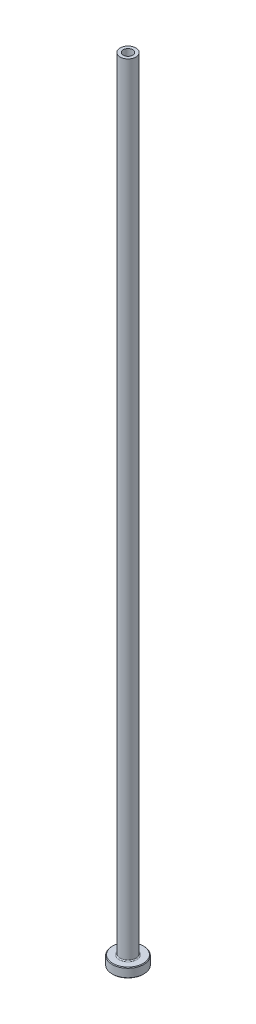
ISO-10303-21;
HEADER;
FILE_DESCRIPTION(('STEP AP214'),'2;1');
FILE_NAME('part.step','',(''),(''),'','','');
FILE_SCHEMA(('AUTOMOTIVE_DESIGN { 1 0 10303 214 1 1 1 1 }'));
ENDSEC;
DATA;
#1=APPLICATION_CONTEXT('core data for automotive mechanical design processes');
#2=APPLICATION_PROTOCOL_DEFINITION('international standard','automotive_design',2000,#1);
#3=PRODUCT_CONTEXT('',#1,'mechanical');
#4=PRODUCT('Part','Part','',(#3));
#5=PRODUCT_RELATED_PRODUCT_CATEGORY('part','',(#4));
#6=PRODUCT_DEFINITION_FORMATION('','',#4);
#7=PRODUCT_DEFINITION_CONTEXT('part definition',#1,'design');
#8=PRODUCT_DEFINITION('design','',#6,#7);
#9=PRODUCT_DEFINITION_SHAPE('','',#8);
#10=(LENGTH_UNIT() NAMED_UNIT(*) SI_UNIT(.MILLI.,.METRE.));
#11=(NAMED_UNIT(*) PLANE_ANGLE_UNIT() SI_UNIT($,.RADIAN.));
#12=(NAMED_UNIT(*) SI_UNIT($,.STERADIAN.) SOLID_ANGLE_UNIT());
#13=UNCERTAINTY_MEASURE_WITH_UNIT(LENGTH_MEASURE(1.E-05),#10,'distance_accuracy_value','');
#14=(GEOMETRIC_REPRESENTATION_CONTEXT(3) GLOBAL_UNCERTAINTY_ASSIGNED_CONTEXT((#13)) GLOBAL_UNIT_ASSIGNED_CONTEXT((#10,
#11,#12)) REPRESENTATION_CONTEXT('',''));
#15=CARTESIAN_POINT('',(0.,0.,0.));
#16=DIRECTION('',(0.,0.,1.));
#17=DIRECTION('',(1.,0.,0.));
#18=AXIS2_PLACEMENT_3D('',#15,#16,#17);
#19=CARTESIAN_POINT('',(0.,92.1876809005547,0.));
#20=DIRECTION('',(0.,1.,0.));
#21=DIRECTION('',(0.,0.,1.));
#22=AXIS2_PLACEMENT_3D('',#19,#20,#21);
#23=CYLINDRICAL_SURFACE('',#22,1.50000000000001);
#24=CARTESIAN_POINT('',(0.,250.,0.));
#25=DIRECTION('',(0.,1.,0.));
#26=DIRECTION('',(0.,0.,1.));
#27=AXIS2_PLACEMENT_3D('',#24,#25,#26);
#28=CIRCLE('',#27,1.50000000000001);
#29=CARTESIAN_POINT('',(0.,250.,1.50000000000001));
#30=VERTEX_POINT('',#29);
#31=EDGE_CURVE('E62',#30,#30,#28,.T.);
#32=ORIENTED_EDGE('',*,*,#31,.T.);
#33=EDGE_LOOP('',(#32));
#34=FACE_BOUND('',#33,.T.);
#35=CARTESIAN_POINT('',(0.,205.,0.));
#36=DIRECTION('',(0.,1.,0.));
#37=DIRECTION('',(0.,0.,1.));
#38=AXIS2_PLACEMENT_3D('',#35,#36,#37);
#39=CIRCLE('',#38,1.50000000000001);
#40=CARTESIAN_POINT('',(0.,205.,1.50000000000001));
#41=VERTEX_POINT('',#40);
#42=EDGE_CURVE('E71',#41,#41,#39,.T.);
#43=ORIENTED_EDGE('',*,*,#42,.F.);
#44=EDGE_LOOP('',(#43));
#45=FACE_BOUND('',#44,.T.);
#46=ADVANCED_FACE('F30',(#34,#45),#23,.F.);
#47=CARTESIAN_POINT('',(-1.50000000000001,250.,0.));
#48=DIRECTION('',(0.,1.,0.));
#49=DIRECTION('',(0.,0.,1.));
#50=AXIS2_PLACEMENT_3D('',#47,#48,#49);
#51=PLANE('',#50);
#52=CARTESIAN_POINT('',(0.,250.,0.));
#53=DIRECTION('',(0.,1.,0.));
#54=DIRECTION('',(0.,0.,1.));
#55=AXIS2_PLACEMENT_3D('',#52,#53,#54);
#56=CIRCLE('',#55,2.50000000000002);
#57=CARTESIAN_POINT('',(0.,250.,2.50000000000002));
#58=VERTEX_POINT('',#57);
#59=EDGE_CURVE('E65',#58,#58,#56,.T.);
#60=ORIENTED_EDGE('',*,*,#59,.T.);
#61=EDGE_LOOP('',(#60));
#62=FACE_BOUND('',#61,.T.);
#63=ORIENTED_EDGE('',*,*,#31,.F.);
#64=EDGE_LOOP('',(#63));
#65=FACE_BOUND('',#64,.T.);
#66=ADVANCED_FACE('F79',(#62,#65),#51,.T.);
#67=CARTESIAN_POINT('',(0.,92.1876809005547,0.));
#68=DIRECTION('',(0.,1.,0.));
#69=DIRECTION('',(0.,0.,1.));
#70=AXIS2_PLACEMENT_3D('',#67,#68,#69);
#71=CYLINDRICAL_SURFACE('',#70,2.5);
#72=CARTESIAN_POINT('',(0.,3.3,0.));
#73=DIRECTION('',(0.,1.,0.));
#74=DIRECTION('',(0.,0.,1.));
#75=AXIS2_PLACEMENT_3D('',#72,#73,#74);
#76=CIRCLE('',#75,2.5);
#77=CARTESIAN_POINT('',(0.,3.3,2.5));
#78=VERTEX_POINT('',#77);
#79=EDGE_CURVE('E59',#78,#78,#76,.T.);
#80=ORIENTED_EDGE('',*,*,#79,.T.);
#81=EDGE_LOOP('',(#80));
#82=FACE_BOUND('',#81,.T.);
#83=ORIENTED_EDGE('',*,*,#59,.F.);
#84=EDGE_LOOP('',(#83));
#85=FACE_BOUND('',#84,.T.);
#86=ADVANCED_FACE('F85',(#82,#85),#71,.T.);
#87=CARTESIAN_POINT('',(-2.49999999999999,3.,0.));
#88=DIRECTION('',(0.,1.,0.));
#89=DIRECTION('',(0.,0.,1.));
#90=AXIS2_PLACEMENT_3D('',#87,#88,#89);
#91=PLANE('',#90);
#92=CARTESIAN_POINT('',(0.,3.,0.));
#93=DIRECTION('',(0.,1.,0.));
#94=DIRECTION('',(0.,0.,1.));
#95=AXIS2_PLACEMENT_3D('',#92,#93,#94);
#96=CIRCLE('',#95,4.8);
#97=CARTESIAN_POINT('',(0.,3.,4.8));
#98=VERTEX_POINT('',#97);
#99=EDGE_CURVE('E53',#98,#98,#96,.T.);
#100=ORIENTED_EDGE('',*,*,#99,.T.);
#101=EDGE_LOOP('',(#100));
#102=FACE_BOUND('',#101,.T.);
#103=CARTESIAN_POINT('',(0.,3.,0.));
#104=DIRECTION('',(0.,1.,0.));
#105=DIRECTION('',(0.,0.,1.));
#106=AXIS2_PLACEMENT_3D('',#103,#104,#105);
#107=CIRCLE('',#106,2.8);
#108=CARTESIAN_POINT('',(0.,3.,2.8));
#109=VERTEX_POINT('',#108);
#110=EDGE_CURVE('E56',#109,#109,#107,.F.);
#111=ORIENTED_EDGE('',*,*,#110,.T.);
#112=EDGE_LOOP('',(#111));
#113=FACE_BOUND('',#112,.T.);
#114=ADVANCED_FACE('F111',(#102,#113),#91,.T.);
#115=CARTESIAN_POINT('',(0.,92.1876809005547,0.));
#116=DIRECTION('',(0.,1.,0.));
#117=DIRECTION('',(0.,0.,1.));
#118=AXIS2_PLACEMENT_3D('',#115,#116,#117);
#119=CYLINDRICAL_SURFACE('',#118,4.99999999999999);
#120=CARTESIAN_POINT('',(0.,2.80000000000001,0.));
#121=DIRECTION('',(0.,1.,0.));
#122=DIRECTION('',(0.,0.,1.));
#123=AXIS2_PLACEMENT_3D('',#120,#121,#122);
#124=CIRCLE('',#123,4.99999999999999);
#125=CARTESIAN_POINT('',(0.,2.80000000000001,4.99999999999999));
#126=VERTEX_POINT('',#125);
#127=EDGE_CURVE('E45',#126,#126,#124,.F.);
#128=ORIENTED_EDGE('',*,*,#127,.T.);
#129=EDGE_LOOP('',(#128));
#130=FACE_BOUND('',#129,.T.);
#131=CARTESIAN_POINT('',(0.,0.200000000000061,0.));
#132=DIRECTION('',(0.,-1.,0.));
#133=DIRECTION('',(0.,0.,-1.));
#134=AXIS2_PLACEMENT_3D('',#131,#132,#133);
#135=CIRCLE('',#134,4.99999999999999);
#136=CARTESIAN_POINT('',(0.,0.200000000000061,-4.99999999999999));
#137=VERTEX_POINT('',#136);
#138=EDGE_CURVE('E50',#137,#137,#135,.F.);
#139=ORIENTED_EDGE('',*,*,#138,.T.);
#140=EDGE_LOOP('',(#139));
#141=FACE_BOUND('',#140,.T.);
#142=ADVANCED_FACE('F108',(#130,#141),#119,.T.);
#143=CARTESIAN_POINT('',(-4.99999999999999,0.,0.));
#144=DIRECTION('',(0.,-1.,0.));
#145=DIRECTION('',(0.,0.,-1.));
#146=AXIS2_PLACEMENT_3D('',#143,#144,#145);
#147=PLANE('',#146);
#148=CARTESIAN_POINT('',(0.,0.,0.));
#149=DIRECTION('',(0.,-1.,0.));
#150=DIRECTION('',(0.,0.,-1.));
#151=AXIS2_PLACEMENT_3D('',#148,#149,#150);
#152=CIRCLE('',#151,2.25);
#153=CARTESIAN_POINT('',(0.,0.,-2.25));
#154=VERTEX_POINT('',#153);
#155=EDGE_CURVE('E37',#154,#154,#152,.F.);
#156=ORIENTED_EDGE('',*,*,#155,.T.);
#157=EDGE_LOOP('',(#156));
#158=FACE_BOUND('',#157,.T.);
#159=CARTESIAN_POINT('',(0.,0.,0.));
#160=DIRECTION('',(0.,-1.,0.));
#161=DIRECTION('',(0.,0.,-1.));
#162=AXIS2_PLACEMENT_3D('',#159,#160,#161);
#163=CIRCLE('',#162,4.79999999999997);
#164=CARTESIAN_POINT('',(0.,0.,-4.79999999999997));
#165=VERTEX_POINT('',#164);
#166=EDGE_CURVE('E41',#165,#165,#163,.T.);
#167=ORIENTED_EDGE('',*,*,#166,.T.);
#168=EDGE_LOOP('',(#167));
#169=FACE_BOUND('',#168,.T.);
#170=ADVANCED_FACE('F110',(#158,#169),#147,.T.);
#171=CARTESIAN_POINT('',(0.,92.1876809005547,0.));
#172=DIRECTION('',(0.,1.,0.));
#173=DIRECTION('',(0.,0.,1.));
#174=AXIS2_PLACEMENT_3D('',#171,#172,#173);
#175=CYLINDRICAL_SURFACE('',#174,1.75);
#176=CARTESIAN_POINT('',(0.,0.500000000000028,0.));
#177=DIRECTION('',(0.,-1.,0.));
#178=DIRECTION('',(0.,0.,-1.));
#179=AXIS2_PLACEMENT_3D('',#176,#177,#178);
#180=CIRCLE('',#179,1.75);
#181=CARTESIAN_POINT('',(0.,0.500000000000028,-1.75));
#182=VERTEX_POINT('',#181);
#183=EDGE_CURVE('E10',#182,#182,#180,.T.);
#184=ORIENTED_EDGE('',*,*,#183,.T.);
#185=EDGE_LOOP('',(#184));
#186=FACE_BOUND('',#185,.T.);
#187=CARTESIAN_POINT('',(0.,193.,0.));
#188=DIRECTION('',(0.,1.,0.));
#189=DIRECTION('',(0.,0.,1.));
#190=AXIS2_PLACEMENT_3D('',#187,#188,#189);
#191=CIRCLE('',#190,1.75000000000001);
#192=CARTESIAN_POINT('',(0.,193.,1.75000000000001));
#193=VERTEX_POINT('',#192);
#194=EDGE_CURVE('E68',#193,#193,#191,.T.);
#195=ORIENTED_EDGE('',*,*,#194,.T.);
#196=EDGE_LOOP('',(#195));
#197=FACE_BOUND('',#196,.T.);
#198=ADVANCED_FACE('F118',(#186,#197),#175,.F.);
#199=CARTESIAN_POINT('',(0.,193.,0.));
#200=DIRECTION('',(0.,-1.,0.));
#201=DIRECTION('',(0.,0.,-1.));
#202=AXIS2_PLACEMENT_3D('',#199,#200,#201);
#203=CONICAL_SURFACE('',#202,1.75000000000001,0.0208303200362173);
#204=ORIENTED_EDGE('',*,*,#42,.T.);
#205=EDGE_LOOP('',(#204));
#206=FACE_BOUND('',#205,.T.);
#207=ORIENTED_EDGE('',*,*,#194,.F.);
#208=EDGE_LOOP('',(#207));
#209=FACE_BOUND('',#208,.T.);
#210=ADVANCED_FACE('F75',(#206,#209),#203,.F.);
#211=CARTESIAN_POINT('',(0.,3.3,0.));
#212=DIRECTION('',(0.,1.,0.));
#213=DIRECTION('',(0.,0.,1.));
#214=AXIS2_PLACEMENT_3D('',#211,#212,#213);
#215=TOROIDAL_SURFACE('',#214,2.8,0.3);
#216=ORIENTED_EDGE('',*,*,#110,.F.);
#217=EDGE_LOOP('',(#216));
#218=FACE_BOUND('',#217,.T.);
#219=ORIENTED_EDGE('',*,*,#79,.F.);
#220=EDGE_LOOP('',(#219));
#221=FACE_BOUND('',#220,.T.);
#222=ADVANCED_FACE('F90',(#218,#221),#215,.F.);
#223=CARTESIAN_POINT('',(0.,3.,0.));
#224=DIRECTION('',(0.,-1.,0.));
#225=DIRECTION('',(0.,0.,-1.));
#226=AXIS2_PLACEMENT_3D('',#223,#224,#225);
#227=CONICAL_SURFACE('',#226,4.8,0.785398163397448);
#228=ORIENTED_EDGE('',*,*,#127,.F.);
#229=EDGE_LOOP('',(#228));
#230=FACE_BOUND('',#229,.T.);
#231=ORIENTED_EDGE('',*,*,#99,.F.);
#232=EDGE_LOOP('',(#231));
#233=FACE_BOUND('',#232,.T.);
#234=ADVANCED_FACE('F93',(#230,#233),#227,.T.);
#235=CARTESIAN_POINT('',(0.,0.200000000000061,0.));
#236=DIRECTION('',(0.,1.,0.));
#237=DIRECTION('',(0.,0.,1.));
#238=AXIS2_PLACEMENT_3D('',#235,#236,#237);
#239=CONICAL_SURFACE('',#238,4.99999999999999,0.785398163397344);
#240=ORIENTED_EDGE('',*,*,#166,.F.);
#241=EDGE_LOOP('',(#240));
#242=FACE_BOUND('',#241,.T.);
#243=ORIENTED_EDGE('',*,*,#138,.F.);
#244=EDGE_LOOP('',(#243));
#245=FACE_BOUND('',#244,.T.);
#246=ADVANCED_FACE('F96',(#242,#245),#239,.T.);
#247=CARTESIAN_POINT('',(0.,0.,0.));
#248=DIRECTION('',(0.,-1.,0.));
#249=DIRECTION('',(0.,0.,-1.));
#250=AXIS2_PLACEMENT_3D('',#247,#248,#249);
#251=CONICAL_SURFACE('',#250,2.25,0.78539816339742);
#252=ORIENTED_EDGE('',*,*,#183,.F.);
#253=EDGE_LOOP('',(#252));
#254=FACE_BOUND('',#253,.T.);
#255=ORIENTED_EDGE('',*,*,#155,.F.);
#256=EDGE_LOOP('',(#255));
#257=FACE_BOUND('',#256,.T.);
#258=ADVANCED_FACE('F32',(#254,#257),#251,.F.);
#259=CLOSED_SHELL('',(#46,#66,#86,#114,#142,#170,#198,#210,#222,#234,#246,#258));
#260=MANIFOLD_SOLID_BREP('B2',#259);
#261=ADVANCED_BREP_SHAPE_REPRESENTATION('',(#18,#260),#14);
#262=SHAPE_DEFINITION_REPRESENTATION(#9,#261);
ENDSEC;
END-ISO-10303-21;
